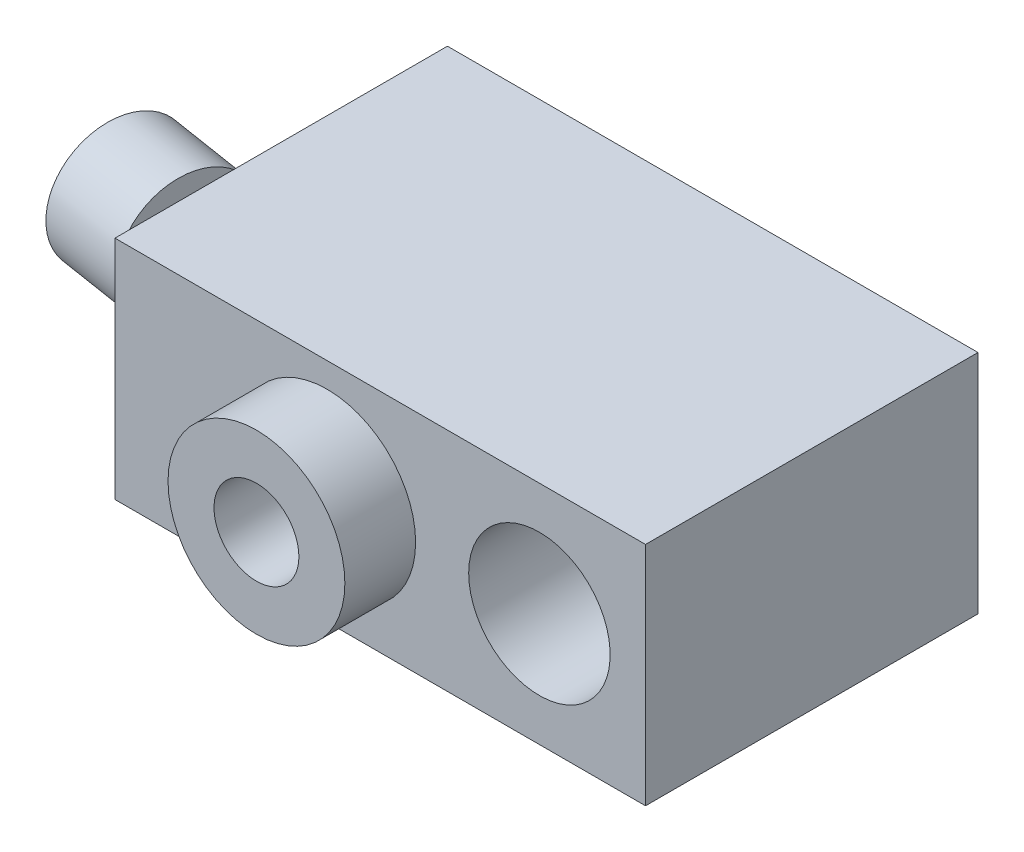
ISO-10303-21;
HEADER;
FILE_DESCRIPTION(('STEP AP214'),'2;1');
FILE_NAME('part.step','',(''),(''),'','','');
FILE_SCHEMA(('AUTOMOTIVE_DESIGN { 1 0 10303 214 1 1 1 1 }'));
ENDSEC;
DATA;
#1=APPLICATION_CONTEXT('core data for automotive mechanical design processes');
#2=APPLICATION_PROTOCOL_DEFINITION('international standard','automotive_design',2000,#1);
#3=PRODUCT_CONTEXT('',#1,'mechanical');
#4=PRODUCT('Part','Part','',(#3));
#5=PRODUCT_RELATED_PRODUCT_CATEGORY('part','',(#4));
#6=PRODUCT_DEFINITION_FORMATION('','',#4);
#7=PRODUCT_DEFINITION_CONTEXT('part definition',#1,'design');
#8=PRODUCT_DEFINITION('design','',#6,#7);
#9=PRODUCT_DEFINITION_SHAPE('','',#8);
#10=(LENGTH_UNIT() NAMED_UNIT(*) SI_UNIT(.MILLI.,.METRE.));
#11=(NAMED_UNIT(*) PLANE_ANGLE_UNIT() SI_UNIT($,.RADIAN.));
#12=(NAMED_UNIT(*) SI_UNIT($,.STERADIAN.) SOLID_ANGLE_UNIT());
#13=UNCERTAINTY_MEASURE_WITH_UNIT(LENGTH_MEASURE(1.E-05),#10,'distance_accuracy_value','');
#14=(GEOMETRIC_REPRESENTATION_CONTEXT(3) GLOBAL_UNCERTAINTY_ASSIGNED_CONTEXT((#13)) GLOBAL_UNIT_ASSIGNED_CONTEXT((#10,
#11,#12)) REPRESENTATION_CONTEXT('',''));
#15=CARTESIAN_POINT('',(0.,0.,0.));
#16=DIRECTION('',(0.,0.,1.));
#17=DIRECTION('',(1.,0.,0.));
#18=AXIS2_PLACEMENT_3D('',#15,#16,#17);
#19=CARTESIAN_POINT('',(-30.,-17.65,23.));
#20=DIRECTION('',(0.,1.,0.));
#21=DIRECTION('',(-1.,0.,0.));
#22=AXIS2_PLACEMENT_3D('',#19,#20,#21);
#23=PLANE('',#22);
#24=CARTESIAN_POINT('',(-30.,-17.65,22.));
#25=DIRECTION('',(0.,1.,0.));
#26=DIRECTION('',(-1.,0.,0.));
#27=AXIS2_PLACEMENT_3D('',#24,#25,#26);
#28=CIRCLE('',#27,1.925);
#29=CARTESIAN_POINT('',(-31.925,-17.65,22.));
#30=VERTEX_POINT('',#29);
#31=EDGE_CURVE('P0_E225',#30,#30,#28,.T.);
#32=ORIENTED_EDGE('',*,*,#31,.F.);
#33=EDGE_LOOP('',(#32));
#34=FACE_BOUND('',#33,.T.);
#35=DIRECTION('',(0.866025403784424,0.,0.50000000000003));
#36=VECTOR('',#35,1.);
#37=CARTESIAN_POINT('',(-29.0669872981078,-17.65,21.3839745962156));
#38=LINE('',#37,#36);
#39=CARTESIAN_POINT('',(-30.,-17.65,20.8452994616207));
#40=VERTEX_POINT('',#39);
#41=CARTESIAN_POINT('',(-29.,-17.65,21.4226497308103));
#42=VERTEX_POINT('',#41);
#43=EDGE_CURVE('P0_E11',#40,#42,#38,.T.);
#44=ORIENTED_EDGE('',*,*,#43,.F.);
#45=DIRECTION('',(0.866025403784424,0.,-0.50000000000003));
#46=VECTOR('',#45,1.);
#47=CARTESIAN_POINT('',(-30.9330127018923,-17.65,21.3839745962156));
#48=LINE('',#47,#46);
#49=CARTESIAN_POINT('',(-31.,-17.65,21.4226497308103));
#50=VERTEX_POINT('',#49);
#51=EDGE_CURVE('P0_E238',#50,#40,#48,.T.);
#52=ORIENTED_EDGE('',*,*,#51,.F.);
#53=DIRECTION('',(0.,0.,-1.));
#54=VECTOR('',#53,1.);
#55=CARTESIAN_POINT('',(-31.,-17.65,23.));
#56=LINE('',#55,#54);
#57=CARTESIAN_POINT('',(-31.,-17.65,22.5773502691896));
#58=VERTEX_POINT('',#57);
#59=EDGE_CURVE('P0_E232',#58,#50,#56,.T.);
#60=ORIENTED_EDGE('',*,*,#59,.F.);
#61=DIRECTION('',(-0.866025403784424,0.,-0.50000000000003));
#62=VECTOR('',#61,1.);
#63=CARTESIAN_POINT('',(-30.0669872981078,-17.65,23.1160254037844));
#64=LINE('',#63,#62);
#65=CARTESIAN_POINT('',(-30.,-17.65,23.1547005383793));
#66=VERTEX_POINT('',#65);
#67=EDGE_CURVE('P0_E229',#66,#58,#64,.T.);
#68=ORIENTED_EDGE('',*,*,#67,.F.);
#69=DIRECTION('',(-0.866025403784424,0.,0.50000000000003));
#70=VECTOR('',#69,1.);
#71=CARTESIAN_POINT('',(-29.9330127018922,-17.65,23.1160254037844));
#72=LINE('',#71,#70);
#73=CARTESIAN_POINT('',(-29.,-17.65,22.5773502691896));
#74=VERTEX_POINT('',#73);
#75=EDGE_CURVE('P0_E235',#74,#66,#72,.T.);
#76=ORIENTED_EDGE('',*,*,#75,.F.);
#77=DIRECTION('',(0.,0.,1.));
#78=VECTOR('',#77,1.);
#79=CARTESIAN_POINT('',(-29.,-17.65,23.));
#80=LINE('',#79,#78);
#81=EDGE_CURVE('P0_E27',#42,#74,#80,.T.);
#82=ORIENTED_EDGE('',*,*,#81,.F.);
#83=EDGE_LOOP('',(#44,#52,#60,#68,#76,#82));
#84=FACE_BOUND('',#83,.T.);
#85=ADVANCED_FACE('P0_F16',(#34,#84),#23,.F.);
#86=CARTESIAN_POINT('',(-30.,-15.5103137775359,22.));
#87=DIRECTION('',(0.,1.,0.));
#88=DIRECTION('',(-1.,0.,0.));
#89=AXIS2_PLACEMENT_3D('',#86,#87,#88);
#90=DEGENERATE_TOROIDAL_SURFACE('',#89,0.0423840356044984,2.84999999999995,.T.);
#91=ORIENTED_EDGE('',*,*,#31,.T.);
#92=EDGE_LOOP('',(#91));
#93=FACE_BOUND('',#92,.T.);
#94=CARTESIAN_POINT('',(-30.,-16.,22.));
#95=DIRECTION('',(0.,1.,0.));
#96=DIRECTION('',(-1.,0.,0.));
#97=AXIS2_PLACEMENT_3D('',#94,#95,#96);
#98=CIRCLE('',#97,2.85);
#99=CARTESIAN_POINT('',(-32.85,-16.,22.));
#100=VERTEX_POINT('',#99);
#101=EDGE_CURVE('P0_E222',#100,#100,#98,.T.);
#102=ORIENTED_EDGE('',*,*,#101,.F.);
#103=EDGE_LOOP('',(#102));
#104=FACE_BOUND('',#103,.T.);
#105=ADVANCED_FACE('P0_F435',(#93,#104),#90,.T.);
#106=CARTESIAN_POINT('',(-30.,-16.61,22.));
#107=DIRECTION('',(0.,1.,0.));
#108=DIRECTION('',(-1.,0.,0.));
#109=AXIS2_PLACEMENT_3D('',#106,#107,#108);
#110=PLANE('',#109);
#111=DIRECTION('',(0.,0.,1.));
#112=VECTOR('',#111,1.);
#113=CARTESIAN_POINT('',(-31.,-16.61,21.4226497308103));
#114=LINE('',#113,#112);
#115=CARTESIAN_POINT('',(-31.,-16.61,21.4226497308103));
#116=VERTEX_POINT('',#115);
#117=CARTESIAN_POINT('',(-31.,-16.61,22.5773502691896));
#118=VERTEX_POINT('',#117);
#119=EDGE_CURVE('P0_E193',#116,#118,#114,.T.);
#120=ORIENTED_EDGE('',*,*,#119,.F.);
#121=DIRECTION('',(-0.866025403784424,0.,0.50000000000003));
#122=VECTOR('',#121,1.);
#123=CARTESIAN_POINT('',(-30.,-16.61,20.8452994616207));
#124=LINE('',#123,#122);
#125=CARTESIAN_POINT('',(-30.,-16.61,20.8452994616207));
#126=VERTEX_POINT('',#125);
#127=EDGE_CURVE('P0_E189',#126,#116,#124,.T.);
#128=ORIENTED_EDGE('',*,*,#127,.F.);
#129=DIRECTION('',(-0.866025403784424,0.,-0.50000000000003));
#130=VECTOR('',#129,1.);
#131=CARTESIAN_POINT('',(-29.,-16.61,21.4226497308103));
#132=LINE('',#131,#130);
#133=CARTESIAN_POINT('',(-29.,-16.61,21.4226497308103));
#134=VERTEX_POINT('',#133);
#135=EDGE_CURVE('P0_E183',#134,#126,#132,.T.);
#136=ORIENTED_EDGE('',*,*,#135,.F.);
#137=DIRECTION('',(0.,0.,-1.));
#138=VECTOR('',#137,1.);
#139=CARTESIAN_POINT('',(-29.,-16.61,22.5773502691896));
#140=LINE('',#139,#138);
#141=CARTESIAN_POINT('',(-29.,-16.61,22.5773502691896));
#142=VERTEX_POINT('',#141);
#143=EDGE_CURVE('P0_E173',#142,#134,#140,.T.);
#144=ORIENTED_EDGE('',*,*,#143,.F.);
#145=DIRECTION('',(0.866025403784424,0.,-0.50000000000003));
#146=VECTOR('',#145,1.);
#147=CARTESIAN_POINT('',(-30.,-16.61,23.1547005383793));
#148=LINE('',#147,#146);
#149=CARTESIAN_POINT('',(-30.,-16.61,23.1547005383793));
#150=VERTEX_POINT('',#149);
#151=EDGE_CURVE('P0_E36',#150,#142,#148,.T.);
#152=ORIENTED_EDGE('',*,*,#151,.F.);
#153=DIRECTION('',(0.866025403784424,0.,0.50000000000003));
#154=VECTOR('',#153,1.);
#155=CARTESIAN_POINT('',(-31.,-16.61,22.5773502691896));
#156=LINE('',#155,#154);
#157=EDGE_CURVE('P0_E196',#118,#150,#156,.T.);
#158=ORIENTED_EDGE('',*,*,#157,.F.);
#159=EDGE_LOOP('',(#120,#128,#136,#144,#152,#158));
#160=FACE_BOUND('',#159,.T.);
#161=ADVANCED_FACE('P0_F439',(#160),#110,.F.);
#162=CARTESIAN_POINT('',(-30.,-16.61,23.1547005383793));
#163=DIRECTION('',(-0.50000000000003,0.,-0.866025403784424));
#164=DIRECTION('',(-0.866025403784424,0.,0.50000000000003));
#165=AXIS2_PLACEMENT_3D('',#162,#163,#164);
#166=PLANE('',#165);
#167=DIRECTION('',(0.,-1.,0.));
#168=VECTOR('',#167,1.);
#169=CARTESIAN_POINT('',(-30.,-16.61,23.1547005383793));
#170=LINE('',#169,#168);
#171=EDGE_CURVE('P0_E199',#150,#66,#170,.T.);
#172=ORIENTED_EDGE('',*,*,#171,.F.);
#173=ORIENTED_EDGE('',*,*,#151,.T.);
#174=DIRECTION('',(0.,-1.,0.));
#175=VECTOR('',#174,1.);
#176=CARTESIAN_POINT('',(-29.,-16.61,22.5773502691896));
#177=LINE('',#176,#175);
#178=EDGE_CURVE('P0_E219',#142,#74,#177,.T.);
#179=ORIENTED_EDGE('',*,*,#178,.T.);
#180=ORIENTED_EDGE('',*,*,#75,.T.);
#181=EDGE_LOOP('',(#172,#173,#179,#180));
#182=FACE_BOUND('',#181,.T.);
#183=ADVANCED_FACE('P0_F441',(#182),#166,.T.);
#184=CARTESIAN_POINT('',(-29.,-16.61,22.5773502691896));
#185=DIRECTION('',(-1.,0.,0.));
#186=DIRECTION('',(0.,-1.,0.));
#187=AXIS2_PLACEMENT_3D('',#184,#185,#186);
#188=PLANE('',#187);
#189=ORIENTED_EDGE('',*,*,#178,.F.);
#190=ORIENTED_EDGE('',*,*,#143,.T.);
#191=DIRECTION('',(0.,-1.,0.));
#192=VECTOR('',#191,1.);
#193=CARTESIAN_POINT('',(-29.,-16.61,21.4226497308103));
#194=LINE('',#193,#192);
#195=EDGE_CURVE('P0_E215',#134,#42,#194,.T.);
#196=ORIENTED_EDGE('',*,*,#195,.T.);
#197=ORIENTED_EDGE('',*,*,#81,.T.);
#198=EDGE_LOOP('',(#189,#190,#196,#197));
#199=FACE_BOUND('',#198,.T.);
#200=ADVANCED_FACE('P0_F444',(#199),#188,.T.);
#201=CARTESIAN_POINT('',(-29.,-16.61,21.4226497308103));
#202=DIRECTION('',(-0.50000000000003,0.,0.866025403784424));
#203=DIRECTION('',(0.866025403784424,0.,0.50000000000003));
#204=AXIS2_PLACEMENT_3D('',#201,#202,#203);
#205=PLANE('',#204);
#206=ORIENTED_EDGE('',*,*,#195,.F.);
#207=ORIENTED_EDGE('',*,*,#135,.T.);
#208=DIRECTION('',(0.,-1.,0.));
#209=VECTOR('',#208,1.);
#210=CARTESIAN_POINT('',(-30.,-16.61,20.8452994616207));
#211=LINE('',#210,#209);
#212=EDGE_CURVE('P0_E211',#126,#40,#211,.T.);
#213=ORIENTED_EDGE('',*,*,#212,.T.);
#214=ORIENTED_EDGE('',*,*,#43,.T.);
#215=EDGE_LOOP('',(#206,#207,#213,#214));
#216=FACE_BOUND('',#215,.T.);
#217=ADVANCED_FACE('P0_F447',(#216),#205,.T.);
#218=CARTESIAN_POINT('',(-30.,-16.61,20.8452994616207));
#219=DIRECTION('',(0.50000000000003,0.,0.866025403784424));
#220=DIRECTION('',(0.866025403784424,0.,-0.50000000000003));
#221=AXIS2_PLACEMENT_3D('',#218,#219,#220);
#222=PLANE('',#221);
#223=ORIENTED_EDGE('',*,*,#212,.F.);
#224=ORIENTED_EDGE('',*,*,#127,.T.);
#225=DIRECTION('',(0.,-1.,0.));
#226=VECTOR('',#225,1.);
#227=CARTESIAN_POINT('',(-31.,-16.61,21.4226497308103));
#228=LINE('',#227,#226);
#229=EDGE_CURVE('P0_E207',#116,#50,#228,.T.);
#230=ORIENTED_EDGE('',*,*,#229,.T.);
#231=ORIENTED_EDGE('',*,*,#51,.T.);
#232=EDGE_LOOP('',(#223,#224,#230,#231));
#233=FACE_BOUND('',#232,.T.);
#234=ADVANCED_FACE('P0_F451',(#233),#222,.T.);
#235=CARTESIAN_POINT('',(-31.,-16.61,21.4226497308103));
#236=DIRECTION('',(1.,0.,0.));
#237=DIRECTION('',(0.,1.,0.));
#238=AXIS2_PLACEMENT_3D('',#235,#236,#237);
#239=PLANE('',#238);
#240=ORIENTED_EDGE('',*,*,#119,.T.);
#241=DIRECTION('',(0.,-1.,0.));
#242=VECTOR('',#241,1.);
#243=CARTESIAN_POINT('',(-31.,-16.61,22.5773502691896));
#244=LINE('',#243,#242);
#245=EDGE_CURVE('P0_E203',#118,#58,#244,.T.);
#246=ORIENTED_EDGE('',*,*,#245,.T.);
#247=ORIENTED_EDGE('',*,*,#59,.T.);
#248=ORIENTED_EDGE('',*,*,#229,.F.);
#249=EDGE_LOOP('',(#240,#246,#247,#248));
#250=FACE_BOUND('',#249,.T.);
#251=ADVANCED_FACE('P0_F455',(#250),#239,.T.);
#252=CARTESIAN_POINT('',(-31.,-16.61,22.5773502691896));
#253=DIRECTION('',(0.50000000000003,0.,-0.866025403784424));
#254=DIRECTION('',(-0.866025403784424,0.,-0.50000000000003));
#255=AXIS2_PLACEMENT_3D('',#252,#253,#254);
#256=PLANE('',#255);
#257=ORIENTED_EDGE('',*,*,#245,.F.);
#258=ORIENTED_EDGE('',*,*,#157,.T.);
#259=ORIENTED_EDGE('',*,*,#171,.T.);
#260=ORIENTED_EDGE('',*,*,#67,.T.);
#261=EDGE_LOOP('',(#257,#258,#259,#260));
#262=FACE_BOUND('',#261,.T.);
#263=ADVANCED_FACE('P0_F431',(#262),#256,.T.);
#264=CARTESIAN_POINT('',(-74.883787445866,-2.88675134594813,20.8803140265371));
#265=DIRECTION('',(0.987688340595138,0.,0.156434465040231));
#266=DIRECTION('',(-0.156434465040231,0.,0.987688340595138));
#267=AXIS2_PLACEMENT_3D('',#264,#265,#266);
#268=PLANE('',#267);
#269=DIRECTION('',(-0.135476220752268,-0.5,0.855363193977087));
#270=VECTOR('',#269,1.);
#271=CARTESIAN_POINT('',(-74.883787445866,-2.88675134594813,20.8803140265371));
#272=LINE('',#271,#270);
#273=CARTESIAN_POINT('',(-74.883787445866,-2.88675134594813,20.8803140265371));
#274=VERTEX_POINT('',#273);
#275=CARTESIAN_POINT('',(-75.6659597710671,-5.77350269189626,25.8187557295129));
#276=VERTEX_POINT('',#275);
#277=EDGE_CURVE('P0_E264',#274,#276,#272,.T.);
#278=ORIENTED_EDGE('',*,*,#277,.T.);
#279=DIRECTION('',(-0.135476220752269,0.5,0.855363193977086));
#280=VECTOR('',#279,1.);
#281=CARTESIAN_POINT('',(-75.6659597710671,-5.77350269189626,25.8187557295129));
#282=LINE('',#281,#280);
#283=CARTESIAN_POINT('',(-76.4481320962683,-2.88675134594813,30.7571974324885));
#284=VERTEX_POINT('',#283);
#285=EDGE_CURVE('P0_E268',#276,#284,#282,.T.);
#286=ORIENTED_EDGE('',*,*,#285,.T.);
#287=DIRECTION('',(0.,1.,0.));
#288=VECTOR('',#287,1.);
#289=CARTESIAN_POINT('',(-76.4481320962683,-2.88675134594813,30.7571974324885));
#290=LINE('',#289,#288);
#291=CARTESIAN_POINT('',(-76.4481320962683,2.88675134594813,30.7571974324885));
#292=VERTEX_POINT('',#291);
#293=EDGE_CURVE('P0_E272',#284,#292,#290,.T.);
#294=ORIENTED_EDGE('',*,*,#293,.T.);
#295=DIRECTION('',(0.135476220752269,0.5,-0.855363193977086));
#296=VECTOR('',#295,1.);
#297=CARTESIAN_POINT('',(-76.4481320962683,2.88675134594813,30.7571974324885));
#298=LINE('',#297,#296);
#299=CARTESIAN_POINT('',(-75.6659597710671,5.77350269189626,25.8187557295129));
#300=VERTEX_POINT('',#299);
#301=EDGE_CURVE('P0_E276',#292,#300,#298,.T.);
#302=ORIENTED_EDGE('',*,*,#301,.T.);
#303=DIRECTION('',(0.135476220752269,-0.5,-0.855363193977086));
#304=VECTOR('',#303,1.);
#305=CARTESIAN_POINT('',(-75.6659597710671,5.77350269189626,25.8187557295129));
#306=LINE('',#305,#304);
#307=CARTESIAN_POINT('',(-74.883787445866,2.88675134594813,20.8803140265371));
#308=VERTEX_POINT('',#307);
#309=EDGE_CURVE('P0_E280',#300,#308,#306,.T.);
#310=ORIENTED_EDGE('',*,*,#309,.T.);
#311=DIRECTION('',(0.,-1.,0.));
#312=VECTOR('',#311,1.);
#313=CARTESIAN_POINT('',(-74.883787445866,2.88675134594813,20.8803140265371));
#314=LINE('',#313,#312);
#315=EDGE_CURVE('P0_E284',#308,#274,#314,.T.);
#316=ORIENTED_EDGE('',*,*,#315,.T.);
#317=EDGE_LOOP('',(#278,#286,#294,#302,#310,#316));
#318=FACE_BOUND('',#317,.T.);
#319=ADVANCED_FACE('P0_F413',(#318),#268,.F.);
#320=CARTESIAN_POINT('',(-76.4481320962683,-2.88675134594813,30.7571974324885));
#321=DIRECTION('',(-0.156434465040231,0.,0.987688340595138));
#322=DIRECTION('',(-0.987688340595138,0.,-0.156434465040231));
#323=AXIS2_PLACEMENT_3D('',#320,#321,#322);
#324=PLANE('',#323);
#325=DIRECTION('',(0.,1.,0.));
#326=VECTOR('',#325,1.);
#327=CARTESIAN_POINT('',(-82.3742621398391,-2.88675134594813,29.8185906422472));
#328=LINE('',#327,#326);
#329=CARTESIAN_POINT('',(-82.3742621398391,-2.88675134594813,29.8185906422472));
#330=VERTEX_POINT('',#329);
#331=CARTESIAN_POINT('',(-82.3742621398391,2.88675134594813,29.8185906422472));
#332=VERTEX_POINT('',#331);
#333=EDGE_CURVE('P0_E249',#330,#332,#328,.T.);
#334=ORIENTED_EDGE('',*,*,#333,.T.);
#335=DIRECTION('',(-0.987688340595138,0.,-0.156434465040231));
#336=VECTOR('',#335,1.);
#337=CARTESIAN_POINT('',(-76.4481320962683,2.88675134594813,30.7571974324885));
#338=LINE('',#337,#336);
#339=EDGE_CURVE('P0_E298',#292,#332,#338,.T.);
#340=ORIENTED_EDGE('',*,*,#339,.F.);
#341=ORIENTED_EDGE('',*,*,#293,.F.);
#342=DIRECTION('',(-0.987688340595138,0.,-0.156434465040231));
#343=VECTOR('',#342,1.);
#344=CARTESIAN_POINT('',(-76.4481320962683,-2.88675134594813,30.7571974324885));
#345=LINE('',#344,#343);
#346=EDGE_CURVE('P0_E301',#284,#330,#345,.T.);
#347=ORIENTED_EDGE('',*,*,#346,.T.);
#348=EDGE_LOOP('',(#334,#340,#341,#347));
#349=FACE_BOUND('',#348,.T.);
#350=ADVANCED_FACE('P0_F414',(#349),#324,.F.);
#351=CARTESIAN_POINT('',(-76.4481320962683,2.88675134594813,30.7571974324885));
#352=DIRECTION('',(-0.0782172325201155,0.866025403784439,0.493844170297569));
#353=DIRECTION('',(0.,0.4953617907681,-0.868686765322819));
#354=AXIS2_PLACEMENT_3D('',#351,#352,#353);
#355=PLANE('',#354);
#356=DIRECTION('',(0.135476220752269,0.5,-0.855363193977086));
#357=VECTOR('',#356,1.);
#358=CARTESIAN_POINT('',(-82.3742621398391,2.88675134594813,29.8185906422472));
#359=LINE('',#358,#357);
#360=CARTESIAN_POINT('',(-81.592089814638,5.77350269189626,24.8801489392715));
#361=VERTEX_POINT('',#360);
#362=EDGE_CURVE('P0_E253',#332,#361,#359,.T.);
#363=ORIENTED_EDGE('',*,*,#362,.T.);
#364=DIRECTION('',(-0.987688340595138,0.,-0.156434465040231));
#365=VECTOR('',#364,1.);
#366=CARTESIAN_POINT('',(-75.6659597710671,5.77350269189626,25.8187557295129));
#367=LINE('',#366,#365);
#368=EDGE_CURVE('P0_E296',#300,#361,#367,.T.);
#369=ORIENTED_EDGE('',*,*,#368,.F.);
#370=ORIENTED_EDGE('',*,*,#301,.F.);
#371=ORIENTED_EDGE('',*,*,#339,.T.);
#372=EDGE_LOOP('',(#363,#369,#370,#371));
#373=FACE_BOUND('',#372,.T.);
#374=ADVANCED_FACE('P0_F421',(#373),#355,.F.);
#375=CARTESIAN_POINT('',(-75.6659597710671,5.77350269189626,25.8187557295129));
#376=DIRECTION('',(0.0782172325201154,0.866025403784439,-0.493844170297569));
#377=DIRECTION('',(0.,-0.4953617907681,-0.868686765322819));
#378=AXIS2_PLACEMENT_3D('',#375,#376,#377);
#379=PLANE('',#378);
#380=DIRECTION('',(0.135476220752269,-0.5,-0.855363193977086));
#381=VECTOR('',#380,1.);
#382=CARTESIAN_POINT('',(-81.592089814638,5.77350269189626,24.8801489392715));
#383=LINE('',#382,#381);
#384=CARTESIAN_POINT('',(-80.8099174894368,2.88675134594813,19.9417072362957));
#385=VERTEX_POINT('',#384);
#386=EDGE_CURVE('P0_E256',#361,#385,#383,.T.);
#387=ORIENTED_EDGE('',*,*,#386,.T.);
#388=DIRECTION('',(-0.987688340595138,0.,-0.156434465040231));
#389=VECTOR('',#388,1.);
#390=CARTESIAN_POINT('',(-74.883787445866,2.88675134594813,20.8803140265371));
#391=LINE('',#390,#389);
#392=EDGE_CURVE('P0_E293',#308,#385,#391,.T.);
#393=ORIENTED_EDGE('',*,*,#392,.F.);
#394=ORIENTED_EDGE('',*,*,#309,.F.);
#395=ORIENTED_EDGE('',*,*,#368,.T.);
#396=EDGE_LOOP('',(#387,#393,#394,#395));
#397=FACE_BOUND('',#396,.T.);
#398=ADVANCED_FACE('P0_F415',(#397),#379,.F.);
#399=CARTESIAN_POINT('',(-74.883787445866,2.88675134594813,20.8803140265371));
#400=DIRECTION('',(0.156434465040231,0.,-0.987688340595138));
#401=DIRECTION('',(0.987688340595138,0.,0.156434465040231));
#402=AXIS2_PLACEMENT_3D('',#399,#400,#401);
#403=PLANE('',#402);
#404=DIRECTION('',(0.,-1.,0.));
#405=VECTOR('',#404,1.);
#406=CARTESIAN_POINT('',(-80.8099174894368,2.88675134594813,19.9417072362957));
#407=LINE('',#406,#405);
#408=CARTESIAN_POINT('',(-80.8099174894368,-2.88675134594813,19.9417072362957));
#409=VERTEX_POINT('',#408);
#410=EDGE_CURVE('P0_E260',#385,#409,#407,.T.);
#411=ORIENTED_EDGE('',*,*,#410,.T.);
#412=DIRECTION('',(-0.987688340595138,0.,-0.156434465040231));
#413=VECTOR('',#412,1.);
#414=CARTESIAN_POINT('',(-74.883787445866,-2.88675134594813,20.8803140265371));
#415=LINE('',#414,#413);
#416=EDGE_CURVE('P0_E289',#274,#409,#415,.T.);
#417=ORIENTED_EDGE('',*,*,#416,.F.);
#418=ORIENTED_EDGE('',*,*,#315,.F.);
#419=ORIENTED_EDGE('',*,*,#392,.T.);
#420=EDGE_LOOP('',(#411,#417,#418,#419));
#421=FACE_BOUND('',#420,.T.);
#422=ADVANCED_FACE('P0_F404',(#421),#403,.F.);
#423=CARTESIAN_POINT('',(-74.883787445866,-2.88675134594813,20.8803140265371));
#424=DIRECTION('',(0.0782172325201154,-0.866025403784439,-0.493844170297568));
#425=DIRECTION('',(0.,-0.495361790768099,0.868686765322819));
#426=AXIS2_PLACEMENT_3D('',#423,#424,#425);
#427=PLANE('',#426);
#428=DIRECTION('',(-0.135476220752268,-0.5,0.855363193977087));
#429=VECTOR('',#428,1.);
#430=CARTESIAN_POINT('',(-80.8099174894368,-2.88675134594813,19.9417072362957));
#431=LINE('',#430,#429);
#432=CARTESIAN_POINT('',(-81.5920898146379,-5.77350269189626,24.8801489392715));
#433=VERTEX_POINT('',#432);
#434=EDGE_CURVE('P0_E242',#409,#433,#431,.T.);
#435=ORIENTED_EDGE('',*,*,#434,.T.);
#436=DIRECTION('',(-0.987688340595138,0.,-0.156434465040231));
#437=VECTOR('',#436,1.);
#438=CARTESIAN_POINT('',(-75.6659597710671,-5.77350269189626,25.8187557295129));
#439=LINE('',#438,#437);
#440=EDGE_CURVE('P0_E288',#276,#433,#439,.T.);
#441=ORIENTED_EDGE('',*,*,#440,.F.);
#442=ORIENTED_EDGE('',*,*,#277,.F.);
#443=ORIENTED_EDGE('',*,*,#416,.T.);
#444=EDGE_LOOP('',(#435,#441,#442,#443));
#445=FACE_BOUND('',#444,.T.);
#446=ADVANCED_FACE('P0_F400',(#445),#427,.F.);
#447=CARTESIAN_POINT('',(-75.6659597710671,-5.77350269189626,25.8187557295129));
#448=DIRECTION('',(-0.0782172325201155,-0.866025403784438,0.493844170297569));
#449=DIRECTION('',(0.,0.4953617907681,0.868686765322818));
#450=AXIS2_PLACEMENT_3D('',#447,#448,#449);
#451=PLANE('',#450);
#452=DIRECTION('',(-0.135476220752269,0.5,0.855363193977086));
#453=VECTOR('',#452,1.);
#454=CARTESIAN_POINT('',(-81.592089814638,-5.77350269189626,24.8801489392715));
#455=LINE('',#454,#453);
#456=EDGE_CURVE('P0_E245',#433,#330,#455,.T.);
#457=ORIENTED_EDGE('',*,*,#456,.T.);
#458=ORIENTED_EDGE('',*,*,#346,.F.);
#459=ORIENTED_EDGE('',*,*,#285,.F.);
#460=ORIENTED_EDGE('',*,*,#440,.T.);
#461=EDGE_LOOP('',(#457,#458,#459,#460));
#462=FACE_BOUND('',#461,.T.);
#463=ADVANCED_FACE('P0_F393',(#462),#451,.F.);
#464=CARTESIAN_POINT('',(-83.,0.,33.7693440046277));
#465=DIRECTION('',(0.987688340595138,0.,0.156434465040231));
#466=DIRECTION('',(-0.156434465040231,0.,0.987688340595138));
#467=AXIS2_PLACEMENT_3D('',#464,#465,#466);
#468=PLANE('',#467);
#469=ORIENTED_EDGE('',*,*,#456,.F.);
#470=ORIENTED_EDGE('',*,*,#434,.F.);
#471=ORIENTED_EDGE('',*,*,#410,.F.);
#472=ORIENTED_EDGE('',*,*,#386,.F.);
#473=ORIENTED_EDGE('',*,*,#362,.F.);
#474=ORIENTED_EDGE('',*,*,#333,.F.);
#475=EDGE_LOOP('',(#469,#470,#471,#472,#473,#474));
#476=FACE_BOUND('',#475,.T.);
#477=CARTESIAN_POINT('',(-81.5920898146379,0.,24.8801489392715));
#478=DIRECTION('',(-0.987688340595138,0.,-0.156434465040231));
#479=DIRECTION('',(0.156434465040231,0.,-0.987688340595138));
#480=AXIS2_PLACEMENT_3D('',#477,#478,#479);
#481=CIRCLE('',#480,9.);
#482=CARTESIAN_POINT('',(-80.1841796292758,0.,15.9909538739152));
#483=VERTEX_POINT('',#482);
#484=EDGE_CURVE('P0_E292',#483,#483,#481,.T.);
#485=ORIENTED_EDGE('',*,*,#484,.T.);
#486=EDGE_LOOP('',(#485));
#487=FACE_BOUND('',#486,.T.);
#488=ADVANCED_FACE('P0_F374',(#476,#487),#468,.F.);
#489=CARTESIAN_POINT('',(-71.,0.,26.5577711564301));
#490=DIRECTION('',(-0.987688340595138,0.,-0.156434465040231));
#491=DIRECTION('',(0.156434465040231,0.,-0.987688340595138));
#492=AXIS2_PLACEMENT_3D('',#489,#490,#491);
#493=CYLINDRICAL_SURFACE('',#492,9.);
#494=CARTESIAN_POINT('',(-69.7398297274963,0.,26.7573625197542));
#495=DIRECTION('',(-0.987688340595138,0.,-0.156434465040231));
#496=DIRECTION('',(0.156434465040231,0.,-0.987688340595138));
#497=AXIS2_PLACEMENT_3D('',#494,#495,#496);
#498=CIRCLE('',#497,9.);
#499=CARTESIAN_POINT('',(-68.3319195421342,0.,17.868167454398));
#500=VERTEX_POINT('',#499);
#501=EDGE_CURVE('P0_E312',#500,#500,#498,.T.);
#502=ORIENTED_EDGE('',*,*,#501,.T.);
#503=EDGE_LOOP('',(#502));
#504=FACE_BOUND('',#503,.T.);
#505=ORIENTED_EDGE('',*,*,#484,.F.);
#506=EDGE_LOOP('',(#505));
#507=FACE_BOUND('',#506,.T.);
#508=ADVANCED_FACE('P0_F383',(#504,#507),#493,.T.);
#509=CARTESIAN_POINT('',(-71.1477399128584,0.,35.6465575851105));
#510=DIRECTION('',(0.987688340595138,0.,0.156434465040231));
#511=DIRECTION('',(-0.156434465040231,0.,0.987688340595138));
#512=AXIS2_PLACEMENT_3D('',#509,#510,#511);
#513=PLANE('',#512);
#514=CARTESIAN_POINT('',(-69.7398297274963,0.,26.7573625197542));
#515=DIRECTION('',(-0.987688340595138,0.,-0.156434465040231));
#516=DIRECTION('',(0.156434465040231,0.,-0.987688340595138));
#517=AXIS2_PLACEMENT_3D('',#514,#515,#516);
#518=CIRCLE('',#517,6.);
#519=CARTESIAN_POINT('',(-68.8012229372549,0.,20.8312324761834));
#520=VERTEX_POINT('',#519);
#521=EDGE_CURVE('P0_E309',#520,#520,#518,.T.);
#522=ORIENTED_EDGE('',*,*,#521,.T.);
#523=EDGE_LOOP('',(#522));
#524=FACE_BOUND('',#523,.T.);
#525=ORIENTED_EDGE('',*,*,#501,.F.);
#526=EDGE_LOOP('',(#525));
#527=FACE_BOUND('',#526,.T.);
#528=ADVANCED_FACE('P0_F375',(#524,#527),#513,.T.);
#529=CARTESIAN_POINT('',(-34.,0.,7.));
#530=DIRECTION('',(0.,0.,1.));
#531=DIRECTION('',(-1.,0.,0.));
#532=AXIS2_PLACEMENT_3D('',#529,#530,#531);
#533=PLANE('',#532);
#534=CARTESIAN_POINT('',(-30.,0.,7.));
#535=DIRECTION('',(0.,0.,1.));
#536=DIRECTION('',(-1.,0.,0.));
#537=AXIS2_PLACEMENT_3D('',#534,#535,#536);
#538=CIRCLE('',#537,12.5);
#539=CARTESIAN_POINT('',(-42.5,0.,7.));
#540=VERTEX_POINT('',#539);
#541=EDGE_CURVE('P0_E316',#540,#540,#538,.T.);
#542=ORIENTED_EDGE('',*,*,#541,.T.);
#543=EDGE_LOOP('',(#542));
#544=FACE_BOUND('',#543,.T.);
#545=ADVANCED_FACE('P0_F376',(#544),#533,.T.);
#546=CARTESIAN_POINT('',(-7.,0.,27.));
#547=DIRECTION('',(0.,0.,1.));
#548=DIRECTION('',(-1.,0.,0.));
#549=AXIS2_PLACEMENT_3D('',#546,#547,#548);
#550=PLANE('',#549);
#551=CARTESIAN_POINT('',(0.,0.,27.));
#552=DIRECTION('',(0.,0.,1.));
#553=DIRECTION('',(-1.,0.,0.));
#554=AXIS2_PLACEMENT_3D('',#551,#552,#553);
#555=CIRCLE('',#554,10.);
#556=CARTESIAN_POINT('',(-10.,0.,27.));
#557=VERTEX_POINT('',#556);
#558=EDGE_CURVE('P0_E332',#557,#557,#555,.T.);
#559=ORIENTED_EDGE('',*,*,#558,.T.);
#560=EDGE_LOOP('',(#559));
#561=FACE_BOUND('',#560,.T.);
#562=CARTESIAN_POINT('',(0.,0.,27.));
#563=DIRECTION('',(0.,0.,1.));
#564=DIRECTION('',(-1.,0.,0.));
#565=AXIS2_PLACEMENT_3D('',#562,#563,#564);
#566=CIRCLE('',#565,7.);
#567=CARTESIAN_POINT('',(-7.,0.,27.));
#568=VERTEX_POINT('',#567);
#569=EDGE_CURVE('P0_E328',#568,#568,#566,.T.);
#570=ORIENTED_EDGE('',*,*,#569,.F.);
#571=EDGE_LOOP('',(#570));
#572=FACE_BOUND('',#571,.T.);
#573=ADVANCED_FACE('P0_F364',(#561,#572),#550,.T.);
#574=CARTESIAN_POINT('',(0.,0.,47.));
#575=DIRECTION('',(0.,0.,1.));
#576=DIRECTION('',(-1.,0.,0.));
#577=AXIS2_PLACEMENT_3D('',#574,#575,#576);
#578=CYLINDRICAL_SURFACE('',#577,7.);
#579=ORIENTED_EDGE('',*,*,#569,.T.);
#580=EDGE_LOOP('',(#579));
#581=FACE_BOUND('',#580,.T.);
#582=CARTESIAN_POINT('',(0.,0.,0.));
#583=DIRECTION('',(0.,0.,1.));
#584=DIRECTION('',(-1.,0.,0.));
#585=AXIS2_PLACEMENT_3D('',#582,#583,#584);
#586=CIRCLE('',#585,7.);
#587=CARTESIAN_POINT('',(-7.,0.,0.));
#588=VERTEX_POINT('',#587);
#589=EDGE_CURVE('P0_E324',#588,#588,#586,.T.);
#590=ORIENTED_EDGE('',*,*,#589,.F.);
#591=EDGE_LOOP('',(#590));
#592=FACE_BOUND('',#591,.T.);
#593=ADVANCED_FACE('P0_F361',(#581,#592),#578,.F.);
#594=CARTESIAN_POINT('',(-71.,0.,26.5577711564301));
#595=DIRECTION('',(-0.987688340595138,0.,-0.156434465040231));
#596=DIRECTION('',(0.156434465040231,0.,-0.987688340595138));
#597=AXIS2_PLACEMENT_3D('',#594,#595,#596);
#598=CYLINDRICAL_SURFACE('',#597,6.);
#599=CARTESIAN_POINT('',(-60.,0.,28.3));
#600=DIRECTION('',(-1.,0.,0.));
#601=DIRECTION('',(0.,0.,-1.));
#602=AXIS2_PLACEMENT_3D('',#599,#600,#601);
#603=ELLIPSE('',#602,6.07479075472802,6.);
#604=CARTESIAN_POINT('',(-60.,0.,22.225209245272));
#605=VERTEX_POINT('',#604);
#606=EDGE_CURVE('P0_E20',#605,#605,#603,.T.);
#607=ORIENTED_EDGE('',*,*,#606,.T.);
#608=EDGE_LOOP('',(#607));
#609=FACE_BOUND('',#608,.T.);
#610=ORIENTED_EDGE('',*,*,#521,.F.);
#611=EDGE_LOOP('',(#610));
#612=FACE_BOUND('',#611,.T.);
#613=ADVANCED_FACE('P0_F363',(#609,#612),#598,.T.);
#614=CARTESIAN_POINT('',(-30.,0.,47.));
#615=DIRECTION('',(0.,0.,1.));
#616=DIRECTION('',(-1.,0.,0.));
#617=AXIS2_PLACEMENT_3D('',#614,#615,#616);
#618=CYLINDRICAL_SURFACE('',#617,12.5);
#619=CARTESIAN_POINT('',(-30.,0.,47.));
#620=DIRECTION('',(0.,0.,1.));
#621=DIRECTION('',(-1.,0.,0.));
#622=AXIS2_PLACEMENT_3D('',#619,#620,#621);
#623=CIRCLE('',#622,12.5);
#624=CARTESIAN_POINT('',(-42.5,0.,47.));
#625=VERTEX_POINT('',#624);
#626=EDGE_CURVE('P0_E320',#625,#625,#623,.T.);
#627=ORIENTED_EDGE('',*,*,#626,.T.);
#628=EDGE_LOOP('',(#627));
#629=FACE_BOUND('',#628,.T.);
#630=ORIENTED_EDGE('',*,*,#541,.F.);
#631=EDGE_LOOP('',(#630));
#632=FACE_BOUND('',#631,.T.);
#633=ADVANCED_FACE('P0_F367',(#629,#632),#618,.F.);
#634=CARTESIAN_POINT('',(-60.,16.,47.));
#635=DIRECTION('',(0.,1.,0.));
#636=DIRECTION('',(-1.,0.,0.));
#637=AXIS2_PLACEMENT_3D('',#634,#635,#636);
#638=PLANE('',#637);
#639=DIRECTION('',(0.,0.,-1.));
#640=VECTOR('',#639,1.);
#641=CARTESIAN_POINT('',(-60.,16.,47.));
#642=LINE('',#641,#640);
#643=CARTESIAN_POINT('',(-60.,16.,47.));
#644=VERTEX_POINT('',#643);
#645=CARTESIAN_POINT('',(-60.,16.,0.));
#646=VERTEX_POINT('',#645);
#647=EDGE_CURVE('P0_E131',#644,#646,#642,.T.);
#648=ORIENTED_EDGE('',*,*,#647,.F.);
#649=DIRECTION('',(1.,0.,0.));
#650=VECTOR('',#649,1.);
#651=CARTESIAN_POINT('',(-60.,16.,47.));
#652=LINE('',#651,#650);
#653=CARTESIAN_POINT('',(15.,16.,47.));
#654=VERTEX_POINT('',#653);
#655=EDGE_CURVE('P0_E146',#644,#654,#652,.T.);
#656=ORIENTED_EDGE('',*,*,#655,.T.);
#657=DIRECTION('',(0.,0.,-1.));
#658=VECTOR('',#657,1.);
#659=CARTESIAN_POINT('',(15.,16.,47.));
#660=LINE('',#659,#658);
#661=CARTESIAN_POINT('',(15.,16.,0.));
#662=VERTEX_POINT('',#661);
#663=EDGE_CURVE('P0_E160',#654,#662,#660,.T.);
#664=ORIENTED_EDGE('',*,*,#663,.T.);
#665=DIRECTION('',(1.,0.,0.));
#666=VECTOR('',#665,1.);
#667=CARTESIAN_POINT('',(-60.,16.,0.));
#668=LINE('',#667,#666);
#669=EDGE_CURVE('P0_E340',#646,#662,#668,.T.);
#670=ORIENTED_EDGE('',*,*,#669,.F.);
#671=EDGE_LOOP('',(#648,#656,#664,#670));
#672=FACE_BOUND('',#671,.T.);
#673=ADVANCED_FACE('P0_F18',(#672),#638,.T.);
#674=CARTESIAN_POINT('',(0.,0.,47.));
#675=DIRECTION('',(0.,0.,1.));
#676=DIRECTION('',(-1.,0.,0.));
#677=AXIS2_PLACEMENT_3D('',#674,#675,#676);
#678=CYLINDRICAL_SURFACE('',#677,10.);
#679=CARTESIAN_POINT('',(0.,0.,47.));
#680=DIRECTION('',(0.,0.,1.));
#681=DIRECTION('',(-1.,0.,0.));
#682=AXIS2_PLACEMENT_3D('',#679,#680,#681);
#683=CIRCLE('',#682,10.);
#684=CARTESIAN_POINT('',(-10.,0.,47.));
#685=VERTEX_POINT('',#684);
#686=EDGE_CURVE('P0_E336',#685,#685,#683,.T.);
#687=ORIENTED_EDGE('',*,*,#686,.T.);
#688=EDGE_LOOP('',(#687));
#689=FACE_BOUND('',#688,.T.);
#690=ORIENTED_EDGE('',*,*,#558,.F.);
#691=EDGE_LOOP('',(#690));
#692=FACE_BOUND('',#691,.T.);
#693=ADVANCED_FACE('P0_F379',(#689,#692),#678,.F.);
#694=CARTESIAN_POINT('',(15.,16.,47.));
#695=DIRECTION('',(1.,0.,0.));
#696=DIRECTION('',(0.,0.,1.));
#697=AXIS2_PLACEMENT_3D('',#694,#695,#696);
#698=PLANE('',#697);
#699=ORIENTED_EDGE('',*,*,#663,.F.);
#700=DIRECTION('',(0.,-1.,0.));
#701=VECTOR('',#700,1.);
#702=CARTESIAN_POINT('',(15.,16.,47.));
#703=LINE('',#702,#701);
#704=CARTESIAN_POINT('',(15.,-16.,47.));
#705=VERTEX_POINT('',#704);
#706=EDGE_CURVE('P0_E141',#654,#705,#703,.T.);
#707=ORIENTED_EDGE('',*,*,#706,.T.);
#708=DIRECTION('',(0.,0.,-1.));
#709=VECTOR('',#708,1.);
#710=CARTESIAN_POINT('',(15.,-16.,47.));
#711=LINE('',#710,#709);
#712=CARTESIAN_POINT('',(15.,-16.,0.));
#713=VERTEX_POINT('',#712);
#714=EDGE_CURVE('P0_E132',#705,#713,#711,.T.);
#715=ORIENTED_EDGE('',*,*,#714,.T.);
#716=DIRECTION('',(0.,-1.,0.));
#717=VECTOR('',#716,1.);
#718=CARTESIAN_POINT('',(15.,16.,0.));
#719=LINE('',#718,#717);
#720=EDGE_CURVE('P0_E153',#662,#713,#719,.T.);
#721=ORIENTED_EDGE('',*,*,#720,.F.);
#722=EDGE_LOOP('',(#699,#707,#715,#721));
#723=FACE_BOUND('',#722,.T.);
#724=ADVANCED_FACE('P0_F353',(#723),#698,.T.);
#725=CARTESIAN_POINT('',(15.,-16.,0.));
#726=DIRECTION('',(0.,0.,-1.));
#727=DIRECTION('',(1.,0.,0.));
#728=AXIS2_PLACEMENT_3D('',#725,#726,#727);
#729=PLANE('',#728);
#730=ORIENTED_EDGE('',*,*,#720,.T.);
#731=DIRECTION('',(-1.,0.,0.));
#732=VECTOR('',#731,1.);
#733=CARTESIAN_POINT('',(15.,-16.,0.));
#734=LINE('',#733,#732);
#735=CARTESIAN_POINT('',(-60.,-16.,0.));
#736=VERTEX_POINT('',#735);
#737=EDGE_CURVE('P0_E344',#713,#736,#734,.T.);
#738=ORIENTED_EDGE('',*,*,#737,.T.);
#739=DIRECTION('',(0.,1.,0.));
#740=VECTOR('',#739,1.);
#741=CARTESIAN_POINT('',(-60.,-16.,0.));
#742=LINE('',#741,#740);
#743=EDGE_CURVE('P0_E126',#736,#646,#742,.T.);
#744=ORIENTED_EDGE('',*,*,#743,.T.);
#745=ORIENTED_EDGE('',*,*,#669,.T.);
#746=EDGE_LOOP('',(#730,#738,#744,#745));
#747=FACE_BOUND('',#746,.T.);
#748=ORIENTED_EDGE('',*,*,#589,.T.);
#749=EDGE_LOOP('',(#748));
#750=FACE_BOUND('',#749,.T.);
#751=ADVANCED_FACE('P0_F355',(#747,#750),#729,.T.);
#752=CARTESIAN_POINT('',(-60.,-16.,47.));
#753=DIRECTION('',(-1.,0.,0.));
#754=DIRECTION('',(0.,-1.,0.));
#755=AXIS2_PLACEMENT_3D('',#752,#753,#754);
#756=PLANE('',#755);
#757=ORIENTED_EDGE('',*,*,#606,.F.);
#758=EDGE_LOOP('',(#757));
#759=FACE_BOUND('',#758,.T.);
#760=DIRECTION('',(0.,0.,-1.));
#761=VECTOR('',#760,1.);
#762=CARTESIAN_POINT('',(-60.,-16.,47.));
#763=LINE('',#762,#761);
#764=CARTESIAN_POINT('',(-60.,-16.,47.));
#765=VERTEX_POINT('',#764);
#766=EDGE_CURVE('P0_E119',#765,#736,#763,.T.);
#767=ORIENTED_EDGE('',*,*,#766,.F.);
#768=DIRECTION('',(0.,1.,0.));
#769=VECTOR('',#768,1.);
#770=CARTESIAN_POINT('',(-60.,-16.,47.));
#771=LINE('',#770,#769);
#772=EDGE_CURVE('P0_E123',#765,#644,#771,.T.);
#773=ORIENTED_EDGE('',*,*,#772,.T.);
#774=ORIENTED_EDGE('',*,*,#647,.T.);
#775=ORIENTED_EDGE('',*,*,#743,.F.);
#776=EDGE_LOOP('',(#767,#773,#774,#775));
#777=FACE_BOUND('',#776,.T.);
#778=ADVANCED_FACE('P0_F121',(#759,#777),#756,.T.);
#779=CARTESIAN_POINT('',(15.,-16.,47.));
#780=DIRECTION('',(0.,0.,-1.));
#781=DIRECTION('',(1.,0.,0.));
#782=AXIS2_PLACEMENT_3D('',#779,#780,#781);
#783=PLANE('',#782);
#784=ORIENTED_EDGE('',*,*,#686,.F.);
#785=EDGE_LOOP('',(#784));
#786=FACE_BOUND('',#785,.T.);
#787=ORIENTED_EDGE('',*,*,#706,.F.);
#788=ORIENTED_EDGE('',*,*,#655,.F.);
#789=ORIENTED_EDGE('',*,*,#772,.F.);
#790=DIRECTION('',(-1.,0.,0.));
#791=VECTOR('',#790,1.);
#792=CARTESIAN_POINT('',(15.,-16.,47.));
#793=LINE('',#792,#791);
#794=EDGE_CURVE('P0_E135',#705,#765,#793,.T.);
#795=ORIENTED_EDGE('',*,*,#794,.F.);
#796=EDGE_LOOP('',(#787,#788,#789,#795));
#797=FACE_BOUND('',#796,.T.);
#798=ORIENTED_EDGE('',*,*,#626,.F.);
#799=EDGE_LOOP('',(#798));
#800=FACE_BOUND('',#799,.T.);
#801=ADVANCED_FACE('P0_F143',(#786,#797,#800),#783,.F.);
#802=CARTESIAN_POINT('',(15.,-16.,47.));
#803=DIRECTION('',(0.,-1.,0.));
#804=DIRECTION('',(1.,0.,0.));
#805=AXIS2_PLACEMENT_3D('',#802,#803,#804);
#806=PLANE('',#805);
#807=ORIENTED_EDGE('',*,*,#101,.T.);
#808=EDGE_LOOP('',(#807));
#809=FACE_BOUND('',#808,.T.);
#810=ORIENTED_EDGE('',*,*,#794,.T.);
#811=ORIENTED_EDGE('',*,*,#766,.T.);
#812=ORIENTED_EDGE('',*,*,#737,.F.);
#813=ORIENTED_EDGE('',*,*,#714,.F.);
#814=EDGE_LOOP('',(#810,#811,#812,#813));
#815=FACE_BOUND('',#814,.T.);
#816=ADVANCED_FACE('P0_F136',(#809,#815),#806,.T.);
#817=CLOSED_SHELL('',(#85,#105,#161,#183,#200,#217,#234,#251,#263,#319,#350,#374,#398,#422,#446,
#463,#488,#508,#528,#545,#573,#593,#613,#633,#673,#693,#724,#751,#778,#801,#816));
#818=MANIFOLD_SOLID_BREP('P0_B1',#817);
#819=CARTESIAN_POINT('',(-25.9999999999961,0.,16.9999999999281));
#820=DIRECTION('',(0.,0.,1.00000000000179));
#821=DIRECTION('',(1.00000000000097,0.,0.));
#822=AXIS2_PLACEMENT_3D('',#819,#820,#821);
#823=PLANE('',#822);
#824=CARTESIAN_POINT('',(-30.,0.,16.9999999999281));
#825=DIRECTION('',(0.,0.,1.00000000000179));
#826=DIRECTION('',(1.00000000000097,0.,0.));
#827=AXIS2_PLACEMENT_3D('',#824,#825,#826);
#828=CIRCLE('',#827,12.5);
#829=CARTESIAN_POINT('',(-17.4999999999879,0.,16.9999999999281));
#830=VERTEX_POINT('',#829);
#831=EDGE_CURVE('P1_E9',#830,#830,#828,.T.);
#832=ORIENTED_EDGE('',*,*,#831,.F.);
#833=EDGE_LOOP('',(#832));
#834=FACE_BOUND('',#833,.T.);
#835=ADVANCED_FACE('P1_F13',(#834),#823,.F.);
#836=CARTESIAN_POINT('',(-30.,0.,57.));
#837=DIRECTION('',(0.,0.,1.00000000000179));
#838=DIRECTION('',(1.00000000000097,0.,0.));
#839=AXIS2_PLACEMENT_3D('',#836,#837,#838);
#840=CYLINDRICAL_SURFACE('',#839,12.5);
#841=CARTESIAN_POINT('',(-30.,0.,57.));
#842=DIRECTION('',(0.,0.,1.00000000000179));
#843=DIRECTION('',(1.00000000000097,0.,0.));
#844=AXIS2_PLACEMENT_3D('',#841,#842,#843);
#845=CIRCLE('',#844,12.5);
#846=CARTESIAN_POINT('',(-17.4999999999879,0.,57.));
#847=VERTEX_POINT('',#846);
#848=EDGE_CURVE('P1_E20',#847,#847,#845,.T.);
#849=ORIENTED_EDGE('',*,*,#848,.F.);
#850=EDGE_LOOP('',(#849));
#851=FACE_BOUND('',#850,.T.);
#852=ORIENTED_EDGE('',*,*,#831,.T.);
#853=EDGE_LOOP('',(#852));
#854=FACE_BOUND('',#853,.T.);
#855=ADVANCED_FACE('P1_F48',(#851,#854),#840,.T.);
#856=CARTESIAN_POINT('',(-17.499999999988,0.,57.));
#857=DIRECTION('',(0.,0.,-1.00000000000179));
#858=DIRECTION('',(-1.00000000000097,0.,0.));
#859=AXIS2_PLACEMENT_3D('',#856,#857,#858);
#860=PLANE('',#859);
#861=CARTESIAN_POINT('',(-30.,0.,57.));
#862=DIRECTION('',(0.,0.,1.00000000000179));
#863=DIRECTION('',(1.00000000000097,0.,0.));
#864=AXIS2_PLACEMENT_3D('',#861,#862,#863);
#865=CIRCLE('',#864,6.);
#866=CARTESIAN_POINT('',(-23.9999999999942,0.,57.));
#867=VERTEX_POINT('',#866);
#868=EDGE_CURVE('P1_E27',#867,#867,#865,.T.);
#869=ORIENTED_EDGE('',*,*,#868,.F.);
#870=EDGE_LOOP('',(#869));
#871=FACE_BOUND('',#870,.T.);
#872=ORIENTED_EDGE('',*,*,#848,.T.);
#873=EDGE_LOOP('',(#872));
#874=FACE_BOUND('',#873,.T.);
#875=ADVANCED_FACE('P1_F43',(#871,#874),#860,.F.);
#876=CARTESIAN_POINT('',(-30.,0.,57.));
#877=DIRECTION('',(0.,0.,1.00000000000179));
#878=DIRECTION('',(1.00000000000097,0.,0.));
#879=AXIS2_PLACEMENT_3D('',#876,#877,#878);
#880=CYLINDRICAL_SURFACE('',#879,6.);
#881=CARTESIAN_POINT('',(-30.,0.,36.9999999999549));
#882=DIRECTION('',(0.,0.,1.));
#883=DIRECTION('',(1.,0.,0.));
#884=AXIS2_PLACEMENT_3D('',#881,#882,#883);
#885=CIRCLE('',#884,6.00000000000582);
#886=CARTESIAN_POINT('',(-23.9999999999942,0.,36.9999999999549));
#887=VERTEX_POINT('',#886);
#888=EDGE_CURVE('P1_E32',#887,#887,#885,.T.);
#889=ORIENTED_EDGE('',*,*,#888,.F.);
#890=EDGE_LOOP('',(#889));
#891=FACE_BOUND('',#890,.T.);
#892=ORIENTED_EDGE('',*,*,#868,.T.);
#893=EDGE_LOOP('',(#892));
#894=FACE_BOUND('',#893,.T.);
#895=ADVANCED_FACE('P1_F40',(#891,#894),#880,.F.);
#896=CARTESIAN_POINT('',(-30.,0.,36.9999999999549));
#897=DIRECTION('',(0.,0.,1.));
#898=DIRECTION('',(1.,0.,0.));
#899=AXIS2_PLACEMENT_3D('',#896,#897,#898);
#900=PLANE('',#899);
#901=ORIENTED_EDGE('',*,*,#888,.T.);
#902=EDGE_LOOP('',(#901));
#903=FACE_BOUND('',#902,.T.);
#904=ADVANCED_FACE('P1_F38',(#903),#900,.T.);
#905=CLOSED_SHELL('',(#835,#855,#875,#895,#904));
#906=MANIFOLD_SOLID_BREP('P1_B1',#905);
#907=ADVANCED_BREP_SHAPE_REPRESENTATION('',(#18,#818,#906),#14);
#908=SHAPE_DEFINITION_REPRESENTATION(#9,#907);
ENDSEC;
END-ISO-10303-21;
